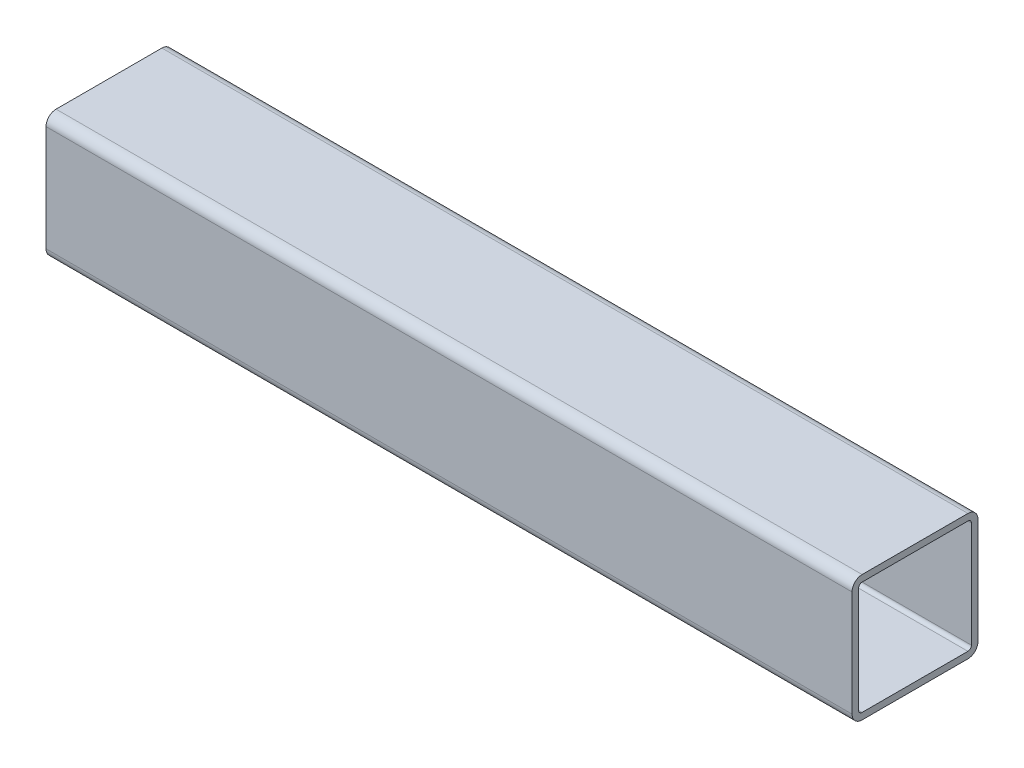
from build123d import *

# Parameters (mm, degrees)
BOSS_EXTRUDE1_DEPTH = 203.2


with BuildPart() as part:
    # Sketch1 → Boss-Extrude1 (new body)
    with BuildSketch(Plane(origin=(0, 0, 0), x_dir=(0, 0, -1), z_dir=(1, 0, 0))):
        with BuildLine():
            Line((0, 2.54), (0, 29.21))
            ThreePointArc((0, 29.21), (-0.743948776, 31.006051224), (-2.54, 31.75))
            Line((-2.54, 31.75), (-29.21, 31.75))
            ThreePointArc((-29.21, 31.75), (-31.006051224, 31.006051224), (-31.75, 29.21))
            Line((-31.75, 29.21), (-31.75, 2.54))
            ThreePointArc((-31.75, 2.54), (-31.006051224, 0.743948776), (-29.21, 0))
            Line((-29.21, 0), (-2.54, 0))
            ThreePointArc((-2.54, 0), (-0.743948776, 0.743948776), (0, 2.54))
        make_face()
        with BuildLine():
            Line((-1.651, 2.54), (-1.651, 29.21))
            ThreePointArc((-1.651, 29.21), (-1.911382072, 29.838617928), (-2.54, 30.099))
            Line((-2.54, 30.099), (-29.21, 30.099))
            ThreePointArc((-29.21, 30.099), (-29.838617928, 29.838617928), (-30.099, 29.21))
            Line((-30.099, 29.21), (-30.099, 2.54))
            ThreePointArc((-30.099, 2.54), (-29.838617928, 1.911382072), (-29.21, 1.651))
            Line((-29.21, 1.651), (-2.54, 1.651))
            ThreePointArc((-2.54, 1.651), (-1.911382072, 1.911382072), (-1.651, 2.54))
        make_face(mode=Mode.SUBTRACT)
    extrude(amount=BOSS_EXTRUDE1_DEPTH)


solid = part.part
